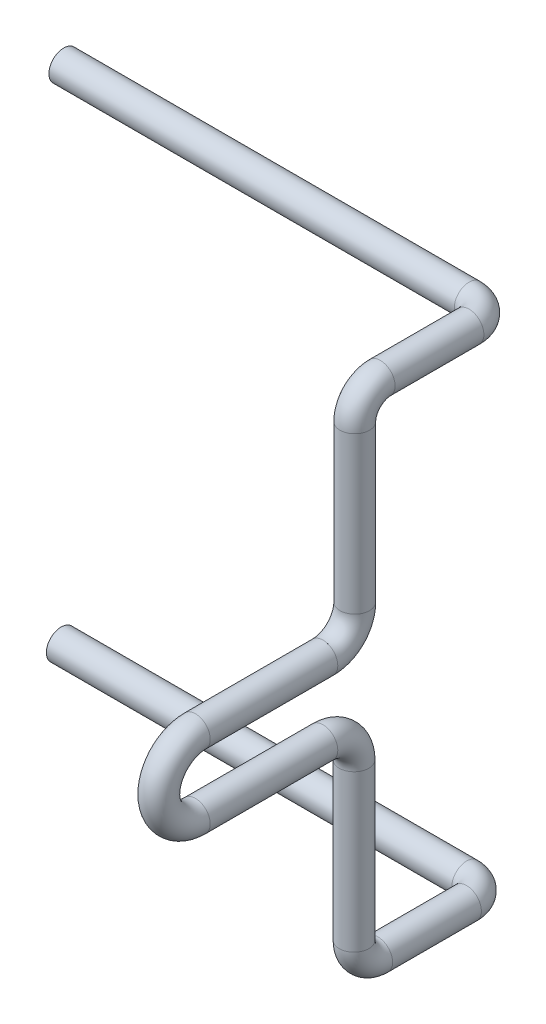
from build123d import *

# Parameters (mm, degrees)
SKETCH1_R            = 1.27
BOSS_EXTRUDE1_DEPTH  = 10.9474
SKETCH2_R            = 1.27
REVOLVE1_ANGLE       = 180
SKETCH3_R            = 1.27
BOSS_EXTRUDE2_DEPTH  = 10.9474
SKETCH5_R            = 1.27
REVOLVE2_ANGLE       = 90
SKETCH6_R            = 1.27
REVOLVE3_ANGLE       = 90
SKETCH7_R            = 1.27
BOSS_EXTRUDE3_DEPTH  = 13.4112
SKETCH8_R            = 1.27
BOSS_EXTRUDE4_DEPTH  = 13.4112
SKETCH9_R            = 1.27
REVOLVE6_ANGLE       = 90
SKETCH10_R           = 1.27
REVOLVE7_ANGLE       = 90
SKETCH13_R           = 1.27
BOSS_EXTRUDE7_DEPTH  = 7.62
SKETCH14_R           = 1.27
BOSS_EXTRUDE8_DEPTH  = 7.62
SKETCH15_R           = 1.27
REVOLVE8_ANGLE       = 90
SKETCH17_R           = 1.27
REVOLVE9_ANGLE       = 90
SKETCH18_R           = 1.27
BOSS_EXTRUDE9_DEPTH  = 34.798
SKETCH19_R           = 1.27
BOSS_EXTRUDE10_DEPTH = 34.798


with BuildPart() as part:
    # Sketch1 → Boss-Extrude1 (new body)
    with BuildSketch(Plane.XY):
        Circle(SKETCH1_R)
    extrude(amount=BOSS_EXTRUDE1_DEPTH)

    # Sketch2 → Revolve1 (revolve)
    with BuildSketch(Plane.XY.offset(10.9474)):
        with Locations(Location((0, 0, 0), (0, 0, 90))):
            Circle(SKETCH2_R)
    revolve(axis=Axis((-3.155064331, -3.145750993, 10.9474), (1, 0, 0)), revolution_arc=REVOLVE1_ANGLE)

    # Sketch3 → Boss-Extrude2 (add)
    with BuildSketch(Plane(origin=(0, 0, 10.9474), x_dir=(-1, 0, 0), z_dir=(0, 0, -1))):
        with Locations(Location((0, -6.291501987, 0), (0, 0, 270))):
            Circle(SKETCH3_R)
    extrude(amount=BOSS_EXTRUDE2_DEPTH)

    # Sketch5 → Revolve2 (revolve)
    with BuildSketch(Plane(origin=(0, 0, 0), x_dir=(-1, 0, 0), z_dir=(0, 0, -1))):
        with Locations(Location((0, -6.291501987, 0), (0, 0, 270))):
            Circle(SKETCH5_R)
    revolve(axis=Axis((3.213491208, -8.956971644, 0), (-1, 0, 0)), revolution_arc=REVOLVE2_ANGLE)

    # Sketch7 → Boss-Extrude3 (add)
    with BuildSketch(Plane.XZ.offset(8.956971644)):
        with Locations(Location((0, -2.665469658, 0), (0, 0, 270))):
            Circle(SKETCH7_R)
    extrude(amount=BOSS_EXTRUDE3_DEPTH)

    # Sketch10 → Revolve7 (revolve)
    with BuildSketch(Plane.XZ.offset(22.368171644)):
        with Locations(Location((0, -2.665469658, 0), (0, 0, 90))):
            Circle(SKETCH10_R)
    revolve(axis=Axis((-2.193874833, -22.368171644, -4.706133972), (1, 0, 0)), revolution_arc=REVOLVE7_ANGLE)

    # Sketch13 → Boss-Extrude7 (add)
    with BuildSketch(Plane(origin=(0, 0, -4.706133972), x_dir=(-1, 0, 0), z_dir=(0, 0, -1))):
        with Locations(Location((0, -24.408835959, 0), (0, 0, 270))):
            Circle(SKETCH13_R)
    extrude(amount=BOSS_EXTRUDE7_DEPTH)

    # Sketch17 → Revolve9 (revolve)
    with BuildSketch(Plane(origin=(0, 0, -12.326133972), x_dir=(-1, 0, 0), z_dir=(0, 0, -1))):
        with Locations(Location((0, -24.408835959, 0), (0, 0, 270))):
            Circle(SKETCH17_R)
    revolve(axis=Axis((-1.821757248, -24.860968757, -12.326133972), (0, 1, 0)), revolution_arc=REVOLVE9_ANGLE)

    # Sketch18 → Boss-Extrude9 (add)
    with BuildSketch(Plane.ZY.offset(1.821757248)):
        with Locations(Location((-14.14789122, -24.408835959, 0), (0, 0, 180))):
            Circle(SKETCH18_R)
    extrude(amount=BOSS_EXTRUDE9_DEPTH)


with BuildPart() as body_2:
    # Sketch6 → Revolve3 (revolve)
    with BuildSketch(Plane(origin=(0, 0, 0), x_dir=(-1, 0, 0), z_dir=(0, 0, -1))):
        with Locations(Location((0, 0, 0), (0, 0, 90))):
            Circle(SKETCH6_R)
    revolve(axis=Axis((2.711005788, 2.727883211, 0), (1, 0, 0)), revolution_arc=REVOLVE3_ANGLE)

    # Sketch8 → Boss-Extrude4 (add)
    with BuildSketch(Plane(origin=(0, 2.727883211, 0), x_dir=(1, 0, 0), z_dir=(0, 1, 0))):
        with Locations(Location((0, 2.727883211, 0), (0, 0, 90))):
            Circle(SKETCH8_R)
    extrude(amount=BOSS_EXTRUDE4_DEPTH)

    # Sketch9 → Revolve6 (revolve)
    with BuildSketch(Plane(origin=(0, 16.139083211, 0), x_dir=(1, 0, 0), z_dir=(0, 1, 0))):
        with Locations(Location((0, 2.727883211, 0), (0, 0, 90))):
            Circle(SKETCH9_R)
    revolve(axis=Axis((-1.886632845, 16.139083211, -4.920863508), (-1, 0, 0)), revolution_arc=REVOLVE6_ANGLE)

    # Sketch14 → Boss-Extrude8 (add)
    with BuildSketch(Plane(origin=(0, 0, -4.920863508), x_dir=(-1, 0, 0), z_dir=(0, 0, -1))):
        with Locations(Location((0, 18.332063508, 0), (0, 0, 90))):
            Circle(SKETCH14_R)
    extrude(amount=BOSS_EXTRUDE8_DEPTH)

    # Sketch15 → Revolve8 (revolve)
    with BuildSketch(Plane(origin=(0, 0, -12.540863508), x_dir=(-1, 0, 0), z_dir=(0, 0, -1))):
        with Locations(Location((0, 18.332063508, 0), (0, 0, 180))):
            Circle(SKETCH15_R)
    revolve(axis=Axis((-2.007828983, 21.532692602, -12.540863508), (0, 1, 0)), revolution_arc=REVOLVE8_ANGLE)

    # Sketch19 → Boss-Extrude10 (add)
    with BuildSketch(Plane.ZY.offset(2.007828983)):
        with Locations(Location((-14.548692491, 18.332063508, 0), (0, 0, 180))):
            Circle(SKETCH19_R)
    extrude(amount=BOSS_EXTRUDE10_DEPTH)


solid = Compound([part.part, body_2.part])
